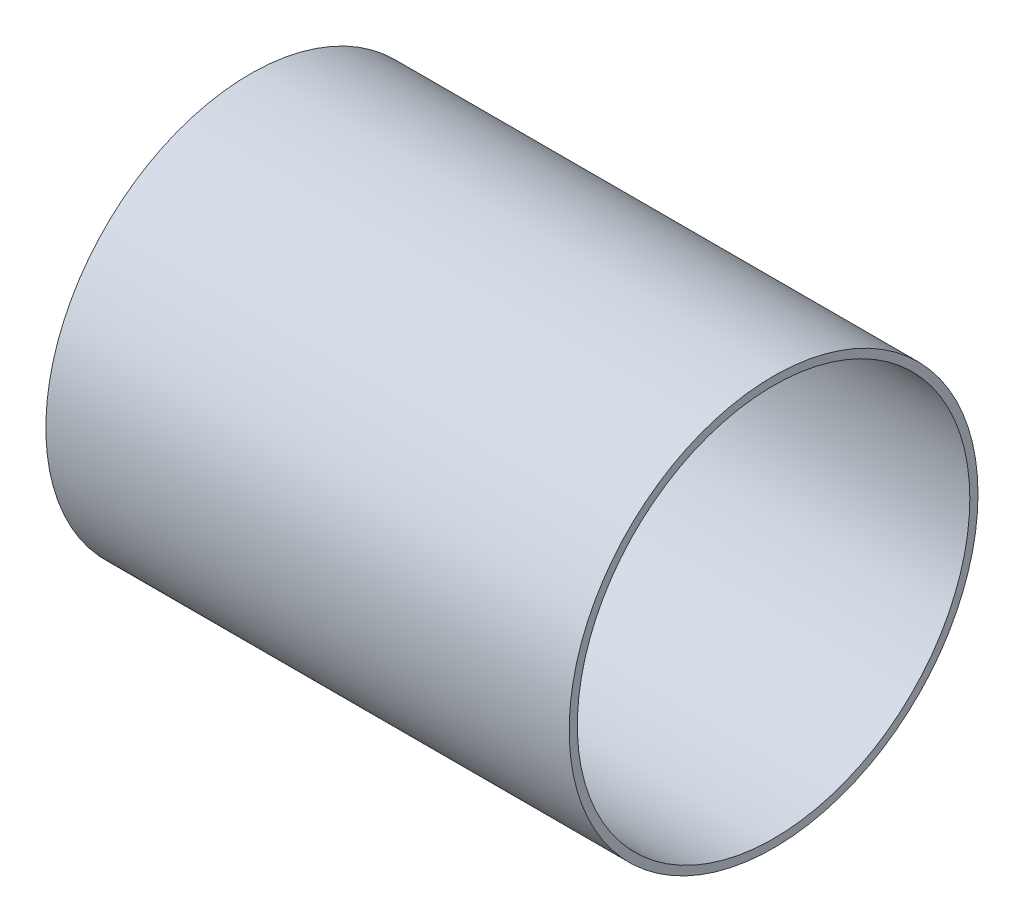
ISO-10303-21;
HEADER;
FILE_DESCRIPTION(('STEP AP214'),'2;1');
FILE_NAME('part.step','',(''),(''),'','','');
FILE_SCHEMA(('AUTOMOTIVE_DESIGN { 1 0 10303 214 1 1 1 1 }'));
ENDSEC;
DATA;
#1=APPLICATION_CONTEXT('core data for automotive mechanical design processes');
#2=APPLICATION_PROTOCOL_DEFINITION('international standard','automotive_design',2000,#1);
#3=PRODUCT_CONTEXT('',#1,'mechanical');
#4=PRODUCT('Part','Part','',(#3));
#5=PRODUCT_RELATED_PRODUCT_CATEGORY('part','',(#4));
#6=PRODUCT_DEFINITION_FORMATION('','',#4);
#7=PRODUCT_DEFINITION_CONTEXT('part definition',#1,'design');
#8=PRODUCT_DEFINITION('design','',#6,#7);
#9=PRODUCT_DEFINITION_SHAPE('','',#8);
#10=(LENGTH_UNIT() NAMED_UNIT(*) SI_UNIT(.MILLI.,.METRE.));
#11=(NAMED_UNIT(*) PLANE_ANGLE_UNIT() SI_UNIT($,.RADIAN.));
#12=(NAMED_UNIT(*) SI_UNIT($,.STERADIAN.) SOLID_ANGLE_UNIT());
#13=UNCERTAINTY_MEASURE_WITH_UNIT(LENGTH_MEASURE(1.E-05),#10,'distance_accuracy_value','');
#14=(GEOMETRIC_REPRESENTATION_CONTEXT(3) GLOBAL_UNCERTAINTY_ASSIGNED_CONTEXT((#13)) GLOBAL_UNIT_ASSIGNED_CONTEXT((#10,
#11,#12)) REPRESENTATION_CONTEXT('',''));
#15=CARTESIAN_POINT('',(0.,0.,0.));
#16=DIRECTION('',(0.,0.,1.));
#17=DIRECTION('',(1.,0.,0.));
#18=AXIS2_PLACEMENT_3D('',#15,#16,#17);
#19=CARTESIAN_POINT('',(203.2,0.,0.));
#20=DIRECTION('',(1.,0.,0.));
#21=DIRECTION('',(0.,0.,-1.));
#22=AXIS2_PLACEMENT_3D('',#19,#20,#21);
#23=PLANE('',#22);
#24=CARTESIAN_POINT('',(203.2,0.,0.));
#25=DIRECTION('',(1.,0.,0.));
#26=DIRECTION('',(0.,0.,-1.));
#27=AXIS2_PLACEMENT_3D('',#24,#25,#26);
#28=CIRCLE('',#27,79.375);
#29=CARTESIAN_POINT('',(203.2,0.,-79.375));
#30=VERTEX_POINT('',#29);
#31=EDGE_CURVE('E10',#30,#30,#28,.T.);
#32=ORIENTED_EDGE('',*,*,#31,.T.);
#33=EDGE_LOOP('',(#32));
#34=FACE_BOUND('',#33,.T.);
#35=CARTESIAN_POINT('',(203.2,0.,0.));
#36=DIRECTION('',(1.,0.,0.));
#37=DIRECTION('',(0.,0.,-1.));
#38=AXIS2_PLACEMENT_3D('',#35,#36,#37);
#39=CIRCLE('',#38,76.2);
#40=CARTESIAN_POINT('',(203.2,0.,-76.2));
#41=VERTEX_POINT('',#40);
#42=EDGE_CURVE('E54',#41,#41,#39,.T.);
#43=ORIENTED_EDGE('',*,*,#42,.F.);
#44=EDGE_LOOP('',(#43));
#45=FACE_BOUND('',#44,.T.);
#46=ADVANCED_FACE('F41',(#34,#45),#23,.T.);
#47=CARTESIAN_POINT('',(0.,0.,0.));
#48=DIRECTION('',(1.,0.,0.));
#49=DIRECTION('',(0.,0.,-1.));
#50=AXIS2_PLACEMENT_3D('',#47,#48,#49);
#51=PLANE('',#50);
#52=CARTESIAN_POINT('',(0.,0.,0.));
#53=DIRECTION('',(1.,0.,0.));
#54=DIRECTION('',(0.,0.,-1.));
#55=AXIS2_PLACEMENT_3D('',#52,#53,#54);
#56=CIRCLE('',#55,79.375);
#57=CARTESIAN_POINT('',(0.,0.,-79.375));
#58=VERTEX_POINT('',#57);
#59=EDGE_CURVE('E44',#58,#58,#56,.T.);
#60=ORIENTED_EDGE('',*,*,#59,.F.);
#61=EDGE_LOOP('',(#60));
#62=FACE_BOUND('',#61,.T.);
#63=CARTESIAN_POINT('',(0.,0.,0.));
#64=DIRECTION('',(1.,0.,0.));
#65=DIRECTION('',(0.,0.,-1.));
#66=AXIS2_PLACEMENT_3D('',#63,#64,#65);
#67=CIRCLE('',#66,76.2);
#68=CARTESIAN_POINT('',(0.,0.,-76.2));
#69=VERTEX_POINT('',#68);
#70=EDGE_CURVE('E60',#69,#69,#67,.T.);
#71=ORIENTED_EDGE('',*,*,#70,.T.);
#72=EDGE_LOOP('',(#71));
#73=FACE_BOUND('',#72,.T.);
#74=ADVANCED_FACE('F68',(#62,#73),#51,.F.);
#75=CARTESIAN_POINT('',(203.2,0.,0.));
#76=DIRECTION('',(-1.,0.,0.));
#77=DIRECTION('',(0.,0.,1.));
#78=AXIS2_PLACEMENT_3D('',#75,#76,#77);
#79=CYLINDRICAL_SURFACE('',#78,79.375);
#80=ORIENTED_EDGE('',*,*,#31,.F.);
#81=EDGE_LOOP('',(#80));
#82=FACE_BOUND('',#81,.T.);
#83=ORIENTED_EDGE('',*,*,#59,.T.);
#84=EDGE_LOOP('',(#83));
#85=FACE_BOUND('',#84,.T.);
#86=ADVANCED_FACE('F43',(#82,#85),#79,.T.);
#87=CARTESIAN_POINT('',(203.2,0.,0.));
#88=DIRECTION('',(-1.,0.,0.));
#89=DIRECTION('',(0.,0.,1.));
#90=AXIS2_PLACEMENT_3D('',#87,#88,#89);
#91=CYLINDRICAL_SURFACE('',#90,76.2);
#92=ORIENTED_EDGE('',*,*,#42,.T.);
#93=EDGE_LOOP('',(#92));
#94=FACE_BOUND('',#93,.T.);
#95=ORIENTED_EDGE('',*,*,#70,.F.);
#96=EDGE_LOOP('',(#95));
#97=FACE_BOUND('',#96,.T.);
#98=ADVANCED_FACE('F67',(#94,#97),#91,.F.);
#99=CLOSED_SHELL('',(#46,#74,#86,#98));
#100=MANIFOLD_SOLID_BREP('B2',#99);
#101=ADVANCED_BREP_SHAPE_REPRESENTATION('',(#18,#100),#14);
#102=SHAPE_DEFINITION_REPRESENTATION(#9,#101);
ENDSEC;
END-ISO-10303-21;
